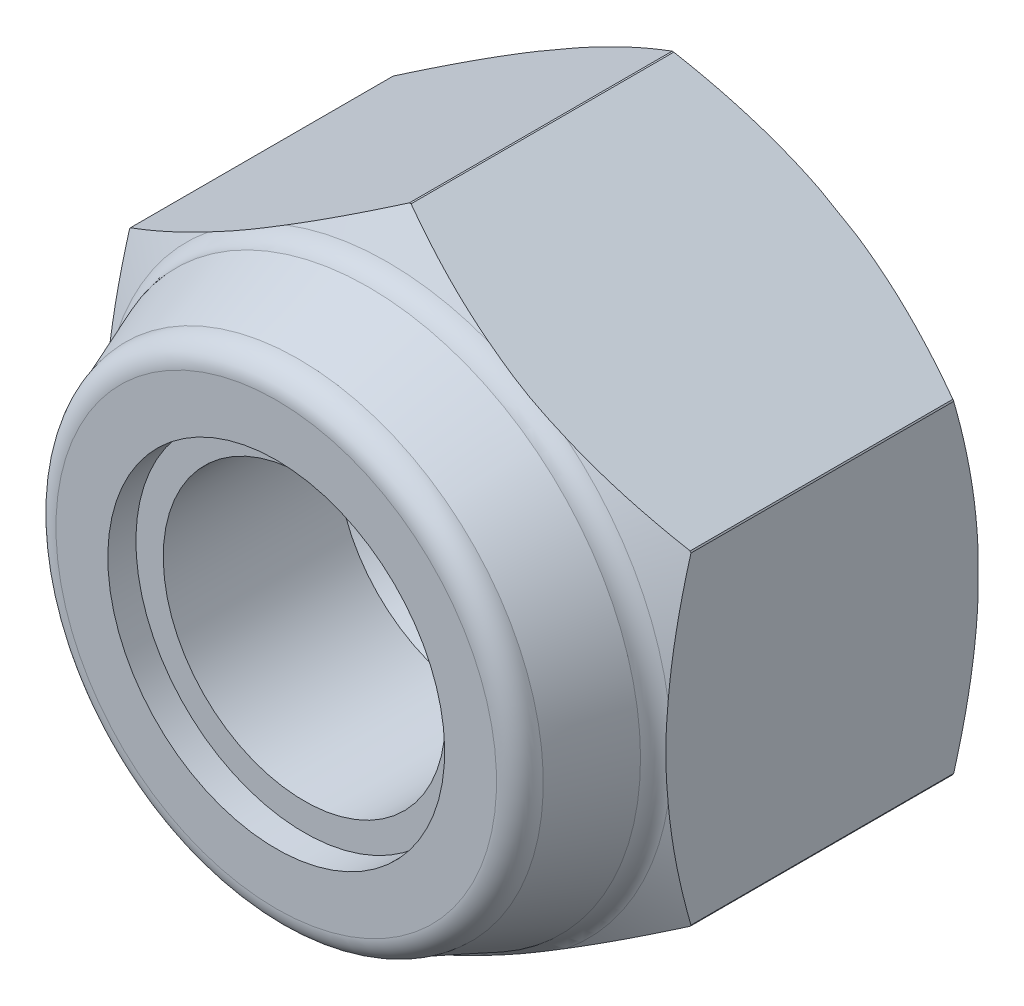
ISO-10303-21;
HEADER;
FILE_DESCRIPTION(('STEP AP214'),'2;1');
FILE_NAME('part.step','',(''),(''),'','','');
FILE_SCHEMA(('AUTOMOTIVE_DESIGN { 1 0 10303 214 1 1 1 1 }'));
ENDSEC;
DATA;
#1=APPLICATION_CONTEXT('core data for automotive mechanical design processes');
#2=APPLICATION_PROTOCOL_DEFINITION('international standard','automotive_design',2000,#1);
#3=PRODUCT_CONTEXT('',#1,'mechanical');
#4=PRODUCT('Part','Part','',(#3));
#5=PRODUCT_RELATED_PRODUCT_CATEGORY('part','',(#4));
#6=PRODUCT_DEFINITION_FORMATION('','',#4);
#7=PRODUCT_DEFINITION_CONTEXT('part definition',#1,'design');
#8=PRODUCT_DEFINITION('design','',#6,#7);
#9=PRODUCT_DEFINITION_SHAPE('','',#8);
#10=(LENGTH_UNIT() NAMED_UNIT(*) SI_UNIT(.MILLI.,.METRE.));
#11=(NAMED_UNIT(*) PLANE_ANGLE_UNIT() SI_UNIT($,.RADIAN.));
#12=(NAMED_UNIT(*) SI_UNIT($,.STERADIAN.) SOLID_ANGLE_UNIT());
#13=UNCERTAINTY_MEASURE_WITH_UNIT(LENGTH_MEASURE(1.E-05),#10,'distance_accuracy_value','');
#14=(GEOMETRIC_REPRESENTATION_CONTEXT(3) GLOBAL_UNCERTAINTY_ASSIGNED_CONTEXT((#13)) GLOBAL_UNIT_ASSIGNED_CONTEXT((#10,
#11,#12)) REPRESENTATION_CONTEXT('',''));
#15=CARTESIAN_POINT('',(0.,0.,0.));
#16=DIRECTION('',(0.,0.,1.));
#17=DIRECTION('',(1.,0.,0.));
#18=AXIS2_PLACEMENT_3D('',#15,#16,#17);
#19=CARTESIAN_POINT('',(0.,2.5075,0.));
#20=DIRECTION('',(0.,0.,-1.));
#21=DIRECTION('',(0.,-1.,0.));
#22=AXIS2_PLACEMENT_3D('',#19,#20,#21);
#23=PLANE('',#22);
#24=DIRECTION('',(-0.866025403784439,-0.5,0.));
#25=VECTOR('',#24,1.);
#26=CARTESIAN_POINT('',(-1.95711032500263,4.64356451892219,0.));
#27=LINE('',#26,#25);
#28=CARTESIAN_POINT('',(-2.16433833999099,4.52392136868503,0.));
#29=VERTEX_POINT('',#28);
#30=CARTESIAN_POINT('',(-2.83566166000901,4.13633266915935,0.));
#31=VERTEX_POINT('',#30);
#32=EDGE_CURVE('E355',#29,#31,#27,.T.);
#33=ORIENTED_EDGE('',*,*,#32,.F.);
#34=CARTESIAN_POINT('',(0.,0.,0.));
#35=DIRECTION('',(0.,0.,1.));
#36=DIRECTION('',(0.,1.,0.));
#37=AXIS2_PLACEMENT_3D('',#34,#35,#36);
#38=CIRCLE('',#37,5.015);
#39=CARTESIAN_POINT('',(2.164338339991,4.52392136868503,0.));
#40=VERTEX_POINT('',#39);
#41=EDGE_CURVE('E284',#40,#29,#38,.T.);
#42=ORIENTED_EDGE('',*,*,#41,.F.);
#43=DIRECTION('',(-0.866025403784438,0.5,0.));
#44=VECTOR('',#43,1.);
#45=CARTESIAN_POINT('',(1.95711032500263,4.64356451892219,0.));
#46=LINE('',#45,#44);
#47=CARTESIAN_POINT('',(2.83566166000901,4.13633266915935,0.));
#48=VERTEX_POINT('',#47);
#49=EDGE_CURVE('E322',#48,#40,#46,.T.);
#50=ORIENTED_EDGE('',*,*,#49,.F.);
#51=CARTESIAN_POINT('',(0.,0.,0.));
#52=DIRECTION('',(0.,0.,1.));
#53=DIRECTION('',(0.,1.,0.));
#54=AXIS2_PLACEMENT_3D('',#51,#52,#53);
#55=CIRCLE('',#54,5.015);
#56=CARTESIAN_POINT('',(5.,0.387588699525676,0.));
#57=VERTEX_POINT('',#56);
#58=EDGE_CURVE('E87',#57,#48,#55,.T.);
#59=ORIENTED_EDGE('',*,*,#58,.F.);
#60=DIRECTION('',(0.,1.,0.));
#61=VECTOR('',#60,1.);
#62=CARTESIAN_POINT('',(5.,1.25375,0.));
#63=LINE('',#62,#61);
#64=CARTESIAN_POINT('',(5.,-0.387588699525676,0.));
#65=VERTEX_POINT('',#64);
#66=EDGE_CURVE('E390',#65,#57,#63,.T.);
#67=ORIENTED_EDGE('',*,*,#66,.F.);
#68=CARTESIAN_POINT('',(0.,0.,0.));
#69=DIRECTION('',(0.,0.,1.));
#70=DIRECTION('',(0.,1.,0.));
#71=AXIS2_PLACEMENT_3D('',#68,#69,#70);
#72=CIRCLE('',#71,5.015);
#73=CARTESIAN_POINT('',(2.835661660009,-4.13633266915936,0.));
#74=VERTEX_POINT('',#73);
#75=EDGE_CURVE('E312',#74,#65,#72,.T.);
#76=ORIENTED_EDGE('',*,*,#75,.F.);
#77=DIRECTION('',(0.866025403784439,0.5,0.));
#78=VECTOR('',#77,1.);
#79=CARTESIAN_POINT('',(3.04288967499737,-4.01668951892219,0.));
#80=LINE('',#79,#78);
#81=CARTESIAN_POINT('',(2.164338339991,-4.52392136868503,0.));
#82=VERTEX_POINT('',#81);
#83=EDGE_CURVE('E252',#82,#74,#80,.T.);
#84=ORIENTED_EDGE('',*,*,#83,.F.);
#85=CARTESIAN_POINT('',(0.,0.,0.));
#86=DIRECTION('',(0.,0.,1.));
#87=DIRECTION('',(0.,1.,0.));
#88=AXIS2_PLACEMENT_3D('',#85,#86,#87);
#89=CIRCLE('',#88,5.015);
#90=CARTESIAN_POINT('',(-2.16433833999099,-4.52392136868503,0.));
#91=VERTEX_POINT('',#90);
#92=EDGE_CURVE('E362',#91,#82,#89,.T.);
#93=ORIENTED_EDGE('',*,*,#92,.F.);
#94=DIRECTION('',(0.866025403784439,-0.5,0.));
#95=VECTOR('',#94,1.);
#96=CARTESIAN_POINT('',(-3.04288967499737,-4.01668951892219,0.));
#97=LINE('',#96,#95);
#98=CARTESIAN_POINT('',(-2.83566166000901,-4.13633266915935,0.));
#99=VERTEX_POINT('',#98);
#100=EDGE_CURVE('E251',#99,#91,#97,.T.);
#101=ORIENTED_EDGE('',*,*,#100,.F.);
#102=CARTESIAN_POINT('',(0.,0.,0.));
#103=DIRECTION('',(0.,0.,1.));
#104=DIRECTION('',(0.,1.,0.));
#105=AXIS2_PLACEMENT_3D('',#102,#103,#104);
#106=CIRCLE('',#105,5.015);
#107=CARTESIAN_POINT('',(-5.,-0.387588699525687,0.));
#108=VERTEX_POINT('',#107);
#109=EDGE_CURVE('E309',#108,#99,#106,.T.);
#110=ORIENTED_EDGE('',*,*,#109,.F.);
#111=DIRECTION('',(0.,-1.,0.));
#112=VECTOR('',#111,1.);
#113=CARTESIAN_POINT('',(-5.,1.25375,0.));
#114=LINE('',#113,#112);
#115=CARTESIAN_POINT('',(-5.,0.387588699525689,0.));
#116=VERTEX_POINT('',#115);
#117=EDGE_CURVE('E219',#116,#108,#114,.T.);
#118=ORIENTED_EDGE('',*,*,#117,.F.);
#119=CARTESIAN_POINT('',(0.,0.,0.));
#120=DIRECTION('',(0.,0.,1.));
#121=DIRECTION('',(0.,1.,0.));
#122=AXIS2_PLACEMENT_3D('',#119,#120,#121);
#123=CIRCLE('',#122,5.015);
#124=EDGE_CURVE('E253',#31,#116,#123,.T.);
#125=ORIENTED_EDGE('',*,*,#124,.F.);
#126=EDGE_LOOP('',(#33,#42,#50,#59,#67,#76,#84,#93,#101,#110,#118,#125));
#127=FACE_BOUND('',#126,.T.);
#128=CARTESIAN_POINT('',(0.,0.,0.));
#129=DIRECTION('',(0.,0.,1.));
#130=DIRECTION('',(0.,1.,0.));
#131=AXIS2_PLACEMENT_3D('',#128,#129,#130);
#132=CIRCLE('',#131,3.);
#133=CARTESIAN_POINT('',(0.,3.,0.));
#134=VERTEX_POINT('',#133);
#135=EDGE_CURVE('E302',#134,#134,#132,.T.);
#136=ORIENTED_EDGE('',*,*,#135,.T.);
#137=EDGE_LOOP('',(#136));
#138=FACE_BOUND('',#137,.T.);
#139=ADVANCED_FACE('F15',(#127,#138),#23,.T.);
#140=CARTESIAN_POINT('',(0.,1.962,7.5));
#141=DIRECTION('',(0.,0.,1.));
#142=DIRECTION('',(0.,1.,0.));
#143=AXIS2_PLACEMENT_3D('',#140,#141,#142);
#144=PLANE('',#143);
#145=CARTESIAN_POINT('',(0.,0.,7.5));
#146=DIRECTION('',(0.,0.,1.));
#147=DIRECTION('',(0.,1.,0.));
#148=AXIS2_PLACEMENT_3D('',#145,#146,#147);
#149=CIRCLE('',#148,3.924);
#150=CARTESIAN_POINT('',(0.,3.924,7.5));
#151=VERTEX_POINT('',#150);
#152=EDGE_CURVE('E9',#151,#151,#149,.T.);
#153=ORIENTED_EDGE('',*,*,#152,.T.);
#154=EDGE_LOOP('',(#153));
#155=FACE_BOUND('',#154,.T.);
#156=CARTESIAN_POINT('',(0.,0.,7.5));
#157=DIRECTION('',(0.,0.,-1.));
#158=DIRECTION('',(0.,1.,0.));
#159=AXIS2_PLACEMENT_3D('',#156,#157,#158);
#160=CIRCLE('',#159,3.);
#161=CARTESIAN_POINT('',(0.,3.,7.5));
#162=VERTEX_POINT('',#161);
#163=EDGE_CURVE('E296',#162,#162,#160,.T.);
#164=ORIENTED_EDGE('',*,*,#163,.T.);
#165=EDGE_LOOP('',(#164));
#166=FACE_BOUND('',#165,.T.);
#167=ADVANCED_FACE('F690',(#155,#166),#144,.T.);
#168=CARTESIAN_POINT('',(0.,0.,7.064));
#169=DIRECTION('',(0.,0.,1.));
#170=DIRECTION('',(1.,0.,0.));
#171=AXIS2_PLACEMENT_3D('',#168,#169,#170);
#172=TOROIDAL_SURFACE('',#171,3.924,0.436);
#173=CARTESIAN_POINT('',(0.,0.,7.10199990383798));
#174=DIRECTION('',(0.,0.,1.));
#175=DIRECTION('',(0.,1.,0.));
#176=AXIS2_PLACEMENT_3D('',#173,#174,#175);
#177=CIRCLE('',#176,4.358340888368);
#178=CARTESIAN_POINT('',(0.,4.358340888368,7.10199990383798));
#179=VERTEX_POINT('',#178);
#180=EDGE_CURVE('E27',#179,#179,#177,.T.);
#181=ORIENTED_EDGE('',*,*,#180,.T.);
#182=EDGE_LOOP('',(#181));
#183=FACE_BOUND('',#182,.T.);
#184=ORIENTED_EDGE('',*,*,#152,.F.);
#185=EDGE_LOOP('',(#184));
#186=FACE_BOUND('',#185,.T.);
#187=ADVANCED_FACE('F724',(#183,#186),#172,.T.);
#188=CARTESIAN_POINT('',(0.,0.,6.47993828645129));
#189=DIRECTION('',(0.,0.,-1.));
#190=DIRECTION('',(0.,1.,0.));
#191=AXIS2_PLACEMENT_3D('',#188,#189,#190);
#192=CONICAL_SURFACE('',#191,4.60252,0.374051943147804);
#193=CARTESIAN_POINT('',(0.,0.,5.85787666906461));
#194=DIRECTION('',(0.,0.,1.));
#195=DIRECTION('',(0.,1.,0.));
#196=AXIS2_PLACEMENT_3D('',#193,#194,#195);
#197=CIRCLE('',#196,4.846699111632);
#198=CARTESIAN_POINT('',(0.,4.846699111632,5.85787666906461));
#199=VERTEX_POINT('',#198);
#200=EDGE_CURVE('E283',#199,#199,#197,.T.);
#201=ORIENTED_EDGE('',*,*,#200,.T.);
#202=EDGE_LOOP('',(#201));
#203=FACE_BOUND('',#202,.T.);
#204=ORIENTED_EDGE('',*,*,#180,.F.);
#205=EDGE_LOOP('',(#204));
#206=FACE_BOUND('',#205,.T.);
#207=ADVANCED_FACE('F608',(#203,#206),#192,.T.);
#208=CARTESIAN_POINT('',(0.,0.,5.31565109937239));
#209=DIRECTION('',(0.,0.,-1.));
#210=DIRECTION('',(0.,1.,0.));
#211=AXIS2_PLACEMENT_3D('',#208,#209,#210);
#212=CONICAL_SURFACE('',#211,5.41402,1.0471975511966);
#213=CARTESIAN_POINT('',(-1.81023153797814,4.72836502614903,5.51828949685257));
#214=CARTESIAN_POINT('',(-0.97069408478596,5.21307220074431,5.43024338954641));
#215=CARTESIAN_POINT('',(-0.0147598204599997,5.76498110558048,5.11301270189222));
#216=(BOUNDED_CURVE() B_SPLINE_CURVE(2,(#213,#214,#215),.UNSPECIFIED.,.F.,
.F.) B_SPLINE_CURVE_WITH_KNOTS((3,3),(0.,2.11486621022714),
.UNSPECIFIED.) CURVE() GEOMETRIC_REPRESENTATION_ITEM() RATIONAL_B_SPLINE_CURVE((1.,
1.01885005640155,1.)) REPRESENTATION_ITEM(''));
#217=CARTESIAN_POINT('',(-1.81023153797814,4.72836502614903,5.51828949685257));
#218=VERTEX_POINT('',#217);
#219=CARTESIAN_POINT('',(-0.0147598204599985,5.76498110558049,5.11301270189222));
#220=VERTEX_POINT('',#219);
#221=EDGE_CURVE('E389',#218,#220,#216,.T.);
#222=ORIENTED_EDGE('',*,*,#221,.F.);
#223=CARTESIAN_POINT('',(0.,0.,5.51828949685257));
#224=DIRECTION('',(0.,0.,1.));
#225=DIRECTION('',(0.,1.,0.));
#226=AXIS2_PLACEMENT_3D('',#223,#224,#225);
#227=CIRCLE('',#226,5.06304);
#228=CARTESIAN_POINT('',(1.81023153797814,4.72836502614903,5.51828949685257));
#229=VERTEX_POINT('',#228);
#230=EDGE_CURVE('E371',#229,#218,#227,.T.);
#231=ORIENTED_EDGE('',*,*,#230,.F.);
#232=CARTESIAN_POINT('',(0.0147598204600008,5.76498110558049,5.11301270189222));
#233=CARTESIAN_POINT('',(0.970694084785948,5.21307220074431,5.4302433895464));
#234=CARTESIAN_POINT('',(1.81023153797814,4.72836502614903,5.51828949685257));
#235=(BOUNDED_CURVE() B_SPLINE_CURVE(2,(#232,#233,#234),.UNSPECIFIED.,.F.,
.F.) B_SPLINE_CURVE_WITH_KNOTS((3,3),(0.,2.11486621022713),
.UNSPECIFIED.) CURVE() GEOMETRIC_REPRESENTATION_ITEM() RATIONAL_B_SPLINE_CURVE((1.,
1.01885005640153,1.)) REPRESENTATION_ITEM(''));
#236=CARTESIAN_POINT('',(0.0147598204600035,5.76498110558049,5.11301270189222));
#237=VERTEX_POINT('',#236);
#238=EDGE_CURVE('E321',#237,#229,#235,.T.);
#239=ORIENTED_EDGE('',*,*,#238,.F.);
#240=CARTESIAN_POINT('',(0.,0.,5.11301270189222));
#241=DIRECTION('',(0.,0.,1.));
#242=DIRECTION('',(0.,1.,0.));
#243=AXIS2_PLACEMENT_3D('',#240,#241,#242);
#244=CIRCLE('',#243,5.765);
#245=EDGE_CURVE('E288',#237,#220,#244,.T.);
#246=ORIENTED_EDGE('',*,*,#245,.T.);
#247=EDGE_LOOP('',(#222,#231,#239,#246));
#248=FACE_BOUND('',#247,.T.);
#249=ADVANCED_FACE('F714',(#248),#212,.T.);
#250=CARTESIAN_POINT('',(0.,0.,2.77301270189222));
#251=DIRECTION('',(0.,0.,-1.));
#252=DIRECTION('',(0.,1.,0.));
#253=AXIS2_PLACEMENT_3D('',#250,#251,#252);
#254=CYLINDRICAL_SURFACE('',#253,5.765);
#255=DIRECTION('',(0.,0.,-1.));
#256=VECTOR('',#255,1.);
#257=CARTESIAN_POINT('',(-0.0147598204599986,5.76498110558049,2.77301270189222));
#258=LINE('',#257,#256);
#259=CARTESIAN_POINT('',(-0.0147598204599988,5.76498110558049,0.43301270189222));
#260=VERTEX_POINT('',#259);
#261=EDGE_CURVE('E384',#220,#260,#258,.T.);
#262=ORIENTED_EDGE('',*,*,#261,.F.);
#263=ORIENTED_EDGE('',*,*,#245,.F.);
#264=DIRECTION('',(0.,0.,1.));
#265=VECTOR('',#264,1.);
#266=CARTESIAN_POINT('',(0.0147598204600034,5.76498110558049,2.77301270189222));
#267=LINE('',#266,#265);
#268=CARTESIAN_POINT('',(0.0147598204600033,5.76498110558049,0.43301270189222));
#269=VERTEX_POINT('',#268);
#270=EDGE_CURVE('E295',#269,#237,#267,.T.);
#271=ORIENTED_EDGE('',*,*,#270,.F.);
#272=CARTESIAN_POINT('',(0.,0.,0.43301270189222));
#273=DIRECTION('',(0.,0.,1.));
#274=DIRECTION('',(0.,1.,0.));
#275=AXIS2_PLACEMENT_3D('',#272,#273,#274);
#276=CIRCLE('',#275,5.765);
#277=EDGE_CURVE('E259',#269,#260,#276,.T.);
#278=ORIENTED_EDGE('',*,*,#277,.T.);
#279=EDGE_LOOP('',(#262,#263,#271,#278));
#280=FACE_BOUND('',#279,.T.);
#281=ADVANCED_FACE('F717',(#280),#254,.T.);
#282=CARTESIAN_POINT('',(0.,0.,0.21650635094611));
#283=DIRECTION('',(0.,0.,1.));
#284=DIRECTION('',(0.,1.,0.));
#285=AXIS2_PLACEMENT_3D('',#282,#283,#284);
#286=CONICAL_SURFACE('',#285,5.39,1.0471975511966);
#287=CARTESIAN_POINT('',(-0.0147598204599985,5.76498110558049,0.43301270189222));
#288=CARTESIAN_POINT('',(-1.16432569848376,5.10127893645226,0.051524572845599));
#289=CARTESIAN_POINT('',(-2.164338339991,4.52392136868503,0.));
#290=(BOUNDED_CURVE() B_SPLINE_CURVE(2,(#287,#288,#289),.UNSPECIFIED.,.F.,
.F.) B_SPLINE_CURVE_WITH_KNOTS((3,3),(0.,2.5240589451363),
.UNSPECIFIED.) CURVE() GEOMETRIC_REPRESENTATION_ITEM() RATIONAL_B_SPLINE_CURVE((1.,
1.02761090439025,1.)) REPRESENTATION_ITEM(''));
#291=EDGE_CURVE('E367',#260,#29,#290,.T.);
#292=ORIENTED_EDGE('',*,*,#291,.F.);
#293=ORIENTED_EDGE('',*,*,#277,.F.);
#294=CARTESIAN_POINT('',(2.16433833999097,4.52392136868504,0.));
#295=CARTESIAN_POINT('',(1.16432569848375,5.10127893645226,0.051524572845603));
#296=CARTESIAN_POINT('',(0.014759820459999,5.76498110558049,0.43301270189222));
#297=(BOUNDED_CURVE() B_SPLINE_CURVE(2,(#294,#295,#296),.UNSPECIFIED.,.F.,
.F.) B_SPLINE_CURVE_WITH_KNOTS((3,3),(0.,2.52405894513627),
.UNSPECIFIED.) CURVE() GEOMETRIC_REPRESENTATION_ITEM() RATIONAL_B_SPLINE_CURVE((1.,
1.02761090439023,1.)) REPRESENTATION_ITEM(''));
#298=EDGE_CURVE('E289',#40,#269,#297,.T.);
#299=ORIENTED_EDGE('',*,*,#298,.F.);
#300=ORIENTED_EDGE('',*,*,#41,.T.);
#301=EDGE_LOOP('',(#292,#293,#299,#300));
#302=FACE_BOUND('',#301,.T.);
#303=ADVANCED_FACE('F763',(#302),#286,.T.);
#304=CARTESIAN_POINT('',(0.,0.,0.21650635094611));
#305=DIRECTION('',(0.,0.,1.));
#306=DIRECTION('',(0.,1.,0.));
#307=AXIS2_PLACEMENT_3D('',#304,#305,#306);
#308=CONICAL_SURFACE('',#307,5.39,1.0471975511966);
#309=CARTESIAN_POINT('',(-2.835661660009,4.13633266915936,0.));
#310=CARTESIAN_POINT('',(-3.83567430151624,3.55897510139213,0.0515245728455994));
#311=CARTESIAN_POINT('',(-4.98524017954,2.89527293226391,0.43301270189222));
#312=(BOUNDED_CURVE() B_SPLINE_CURVE(2,(#309,#310,#311),.UNSPECIFIED.,.F.,
.F.) B_SPLINE_CURVE_WITH_KNOTS((3,3),(0.,2.5240589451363),
.UNSPECIFIED.) CURVE() GEOMETRIC_REPRESENTATION_ITEM() RATIONAL_B_SPLINE_CURVE((1.,
1.02761090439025,1.)) REPRESENTATION_ITEM(''));
#313=CARTESIAN_POINT('',(-4.98524017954,2.89527293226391,0.43301270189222));
#314=VERTEX_POINT('',#313);
#315=EDGE_CURVE('E348',#31,#314,#312,.T.);
#316=ORIENTED_EDGE('',*,*,#315,.F.);
#317=ORIENTED_EDGE('',*,*,#124,.T.);
#318=CARTESIAN_POINT('',(-5.,2.86970817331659,0.43301270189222));
#319=CARTESIAN_POINT('',(-5.,1.54230383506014,0.0515245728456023));
#320=CARTESIAN_POINT('',(-5.,0.387588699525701,0.));
#321=(BOUNDED_CURVE() B_SPLINE_CURVE(2,(#318,#319,#320),.UNSPECIFIED.,.F.,
.F.) B_SPLINE_CURVE_WITH_KNOTS((3,3),(0.,2.52405894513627),
.UNSPECIFIED.) CURVE() GEOMETRIC_REPRESENTATION_ITEM() RATIONAL_B_SPLINE_CURVE((1.,
1.02761090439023,1.)) REPRESENTATION_ITEM(''));
#322=CARTESIAN_POINT('',(-5.,2.86970817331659,0.43301270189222));
#323=VERTEX_POINT('',#322);
#324=EDGE_CURVE('E224',#323,#116,#321,.T.);
#325=ORIENTED_EDGE('',*,*,#324,.F.);
#326=CARTESIAN_POINT('',(0.,0.,0.43301270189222));
#327=DIRECTION('',(0.,0.,1.));
#328=DIRECTION('',(0.,1.,0.));
#329=AXIS2_PLACEMENT_3D('',#326,#327,#328);
#330=CIRCLE('',#329,5.765);
#331=EDGE_CURVE('E374',#314,#323,#330,.T.);
#332=ORIENTED_EDGE('',*,*,#331,.F.);
#333=EDGE_LOOP('',(#316,#317,#325,#332));
#334=FACE_BOUND('',#333,.T.);
#335=ADVANCED_FACE('F862',(#334),#308,.T.);
#336=CARTESIAN_POINT('',(0.,0.,0.21650635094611));
#337=DIRECTION('',(0.,0.,1.));
#338=DIRECTION('',(0.,1.,0.));
#339=AXIS2_PLACEMENT_3D('',#336,#337,#338);
#340=CONICAL_SURFACE('',#339,5.39,1.0471975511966);
#341=CARTESIAN_POINT('',(4.98524017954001,2.89527293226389,0.43301270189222));
#342=CARTESIAN_POINT('',(3.83567430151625,3.55897510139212,0.0515245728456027));
#343=CARTESIAN_POINT('',(2.83566166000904,4.13633266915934,0.));
#344=(BOUNDED_CURVE() B_SPLINE_CURVE(2,(#341,#342,#343),.UNSPECIFIED.,.F.,
.F.) B_SPLINE_CURVE_WITH_KNOTS((3,3),(0.,2.52405894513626),
.UNSPECIFIED.) CURVE() GEOMETRIC_REPRESENTATION_ITEM() RATIONAL_B_SPLINE_CURVE((1.,
1.02761090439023,1.)) REPRESENTATION_ITEM(''));
#345=CARTESIAN_POINT('',(4.98524017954,2.8952729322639,0.433012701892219));
#346=VERTEX_POINT('',#345);
#347=EDGE_CURVE('E327',#346,#48,#344,.T.);
#348=ORIENTED_EDGE('',*,*,#347,.F.);
#349=CARTESIAN_POINT('',(0.,0.,0.43301270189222));
#350=DIRECTION('',(0.,0.,1.));
#351=DIRECTION('',(0.,1.,0.));
#352=AXIS2_PLACEMENT_3D('',#349,#350,#351);
#353=CIRCLE('',#352,5.765);
#354=CARTESIAN_POINT('',(5.,2.86970817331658,0.433012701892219));
#355=VERTEX_POINT('',#354);
#356=EDGE_CURVE('E98',#355,#346,#353,.T.);
#357=ORIENTED_EDGE('',*,*,#356,.F.);
#358=CARTESIAN_POINT('',(5.,0.387588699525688,0.));
#359=CARTESIAN_POINT('',(5.00000000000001,1.54230383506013,0.0515245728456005));
#360=CARTESIAN_POINT('',(5.,2.86970817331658,0.433012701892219));
#361=(BOUNDED_CURVE() B_SPLINE_CURVE(2,(#358,#359,#360),.UNSPECIFIED.,.F.,
.F.) B_SPLINE_CURVE_WITH_KNOTS((3,3),(0.,2.52405894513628),
.UNSPECIFIED.) CURVE() GEOMETRIC_REPRESENTATION_ITEM() RATIONAL_B_SPLINE_CURVE((1.,
1.02761090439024,1.)) REPRESENTATION_ITEM(''));
#362=EDGE_CURVE('E326',#57,#355,#361,.T.);
#363=ORIENTED_EDGE('',*,*,#362,.F.);
#364=ORIENTED_EDGE('',*,*,#58,.T.);
#365=EDGE_LOOP('',(#348,#357,#363,#364));
#366=FACE_BOUND('',#365,.T.);
#367=ADVANCED_FACE('F875',(#366),#340,.T.);
#368=CARTESIAN_POINT('',(0.,0.,0.21650635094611));
#369=DIRECTION('',(0.,0.,1.));
#370=DIRECTION('',(0.,1.,0.));
#371=AXIS2_PLACEMENT_3D('',#368,#369,#370);
#372=CONICAL_SURFACE('',#371,5.39,1.0471975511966);
#373=CARTESIAN_POINT('',(-5.,-0.387588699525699,0.));
#374=CARTESIAN_POINT('',(-5.,-1.54230383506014,0.0515245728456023));
#375=CARTESIAN_POINT('',(-5.,-2.86970817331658,0.43301270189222));
#376=(BOUNDED_CURVE() B_SPLINE_CURVE(2,(#373,#374,#375),.UNSPECIFIED.,.F.,
.F.) B_SPLINE_CURVE_WITH_KNOTS((3,3),(0.,2.52405894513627),
.UNSPECIFIED.) CURVE() GEOMETRIC_REPRESENTATION_ITEM() RATIONAL_B_SPLINE_CURVE((1.,
1.02761090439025,1.)) REPRESENTATION_ITEM(''));
#377=CARTESIAN_POINT('',(-5.,-2.86970817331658,0.43301270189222));
#378=VERTEX_POINT('',#377);
#379=EDGE_CURVE('E196',#108,#378,#376,.T.);
#380=ORIENTED_EDGE('',*,*,#379,.F.);
#381=ORIENTED_EDGE('',*,*,#109,.T.);
#382=CARTESIAN_POINT('',(-4.98524017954,-2.8952729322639,0.43301270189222));
#383=CARTESIAN_POINT('',(-3.83567430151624,-3.55897510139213,0.0515245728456));
#384=CARTESIAN_POINT('',(-2.83566166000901,-4.13633266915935,0.));
#385=(BOUNDED_CURVE() B_SPLINE_CURVE(2,(#382,#383,#384),.UNSPECIFIED.,.F.,
.F.) B_SPLINE_CURVE_WITH_KNOTS((3,3),(0.,2.52405894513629),
.UNSPECIFIED.) CURVE() GEOMETRIC_REPRESENTATION_ITEM() RATIONAL_B_SPLINE_CURVE((1.,
1.02761090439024,1.)) REPRESENTATION_ITEM(''));
#386=CARTESIAN_POINT('',(-4.98524017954,-2.8952729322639,0.43301270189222));
#387=VERTEX_POINT('',#386);
#388=EDGE_CURVE('E199',#387,#99,#385,.T.);
#389=ORIENTED_EDGE('',*,*,#388,.F.);
#390=CARTESIAN_POINT('',(0.,0.,0.43301270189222));
#391=DIRECTION('',(0.,0.,1.));
#392=DIRECTION('',(0.,1.,0.));
#393=AXIS2_PLACEMENT_3D('',#390,#391,#392);
#394=CIRCLE('',#393,5.765);
#395=EDGE_CURVE('E192',#378,#387,#394,.T.);
#396=ORIENTED_EDGE('',*,*,#395,.F.);
#397=EDGE_LOOP('',(#380,#381,#389,#396));
#398=FACE_BOUND('',#397,.T.);
#399=ADVANCED_FACE('F194',(#398),#372,.T.);
#400=CARTESIAN_POINT('',(0.,0.,0.21650635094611));
#401=DIRECTION('',(0.,0.,1.));
#402=DIRECTION('',(0.,1.,0.));
#403=AXIS2_PLACEMENT_3D('',#400,#401,#402);
#404=CONICAL_SURFACE('',#403,5.39,1.0471975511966);
#405=CARTESIAN_POINT('',(5.,-2.86970817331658,0.433012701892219));
#406=CARTESIAN_POINT('',(5.00000000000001,-1.54230383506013,0.0515245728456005));
#407=CARTESIAN_POINT('',(5.,-0.387588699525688,0.));
#408=(BOUNDED_CURVE() B_SPLINE_CURVE(2,(#405,#406,#407),.UNSPECIFIED.,.F.,
.F.) B_SPLINE_CURVE_WITH_KNOTS((3,3),(0.,2.52405894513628),
.UNSPECIFIED.) CURVE() GEOMETRIC_REPRESENTATION_ITEM() RATIONAL_B_SPLINE_CURVE((1.,
1.02761090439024,1.)) REPRESENTATION_ITEM(''));
#409=CARTESIAN_POINT('',(5.,-2.86970817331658,0.433012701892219));
#410=VERTEX_POINT('',#409);
#411=EDGE_CURVE('E245',#410,#65,#408,.T.);
#412=ORIENTED_EDGE('',*,*,#411,.F.);
#413=CARTESIAN_POINT('',(0.,0.,0.43301270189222));
#414=DIRECTION('',(0.,0.,1.));
#415=DIRECTION('',(0.,1.,0.));
#416=AXIS2_PLACEMENT_3D('',#413,#414,#415);
#417=CIRCLE('',#416,5.765);
#418=CARTESIAN_POINT('',(4.98524017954,-2.8952729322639,0.433012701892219));
#419=VERTEX_POINT('',#418);
#420=EDGE_CURVE('E204',#419,#410,#417,.T.);
#421=ORIENTED_EDGE('',*,*,#420,.F.);
#422=CARTESIAN_POINT('',(2.83566166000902,-4.13633266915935,0.));
#423=CARTESIAN_POINT('',(3.83567430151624,-3.55897510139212,0.0515245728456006));
#424=CARTESIAN_POINT('',(4.98524017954,-2.8952729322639,0.43301270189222));
#425=(BOUNDED_CURVE() B_SPLINE_CURVE(2,(#422,#423,#424),.UNSPECIFIED.,.F.,
.F.) B_SPLINE_CURVE_WITH_KNOTS((3,3),(0.,2.52405894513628),
.UNSPECIFIED.) CURVE() GEOMETRIC_REPRESENTATION_ITEM() RATIONAL_B_SPLINE_CURVE((1.,
1.02761090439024,1.)) REPRESENTATION_ITEM(''));
#426=EDGE_CURVE('E265',#74,#419,#425,.T.);
#427=ORIENTED_EDGE('',*,*,#426,.F.);
#428=ORIENTED_EDGE('',*,*,#75,.T.);
#429=EDGE_LOOP('',(#412,#421,#427,#428));
#430=FACE_BOUND('',#429,.T.);
#431=ADVANCED_FACE('F691',(#430),#404,.T.);
#432=CARTESIAN_POINT('',(0.,0.,0.21650635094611));
#433=DIRECTION('',(0.,0.,1.));
#434=DIRECTION('',(0.,1.,0.));
#435=AXIS2_PLACEMENT_3D('',#432,#433,#434);
#436=CONICAL_SURFACE('',#435,5.39,1.0471975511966);
#437=CARTESIAN_POINT('',(-2.16433833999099,-4.52392136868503,0.));
#438=CARTESIAN_POINT('',(-1.16432569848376,-5.10127893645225,0.0515245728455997));
#439=CARTESIAN_POINT('',(-0.0147598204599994,-5.76498110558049,0.43301270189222));
#440=(BOUNDED_CURVE() B_SPLINE_CURVE(2,(#437,#438,#439),.UNSPECIFIED.,.F.,
.F.) B_SPLINE_CURVE_WITH_KNOTS((3,3),(0.,2.52405894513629),
.UNSPECIFIED.) CURVE() GEOMETRIC_REPRESENTATION_ITEM() RATIONAL_B_SPLINE_CURVE((1.,
1.02761090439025,1.)) REPRESENTATION_ITEM(''));
#441=CARTESIAN_POINT('',(-0.0147598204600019,-5.76498110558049,0.43301270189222));
#442=VERTEX_POINT('',#441);
#443=EDGE_CURVE('E230',#91,#442,#440,.T.);
#444=ORIENTED_EDGE('',*,*,#443,.F.);
#445=ORIENTED_EDGE('',*,*,#92,.T.);
#446=CARTESIAN_POINT('',(0.0147598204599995,-5.76498110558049,0.43301270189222));
#447=CARTESIAN_POINT('',(1.16432569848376,-5.10127893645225,0.0515245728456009));
#448=CARTESIAN_POINT('',(2.16433833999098,-4.52392136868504,0.));
#449=(BOUNDED_CURVE() B_SPLINE_CURVE(2,(#446,#447,#448),.UNSPECIFIED.,.F.,
.F.) B_SPLINE_CURVE_WITH_KNOTS((3,3),(0.,2.52405894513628),
.UNSPECIFIED.) CURVE() GEOMETRIC_REPRESENTATION_ITEM() RATIONAL_B_SPLINE_CURVE((1.,
1.02761090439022,1.)) REPRESENTATION_ITEM(''));
#450=CARTESIAN_POINT('',(0.0147598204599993,-5.76498110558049,0.43301270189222));
#451=VERTEX_POINT('',#450);
#452=EDGE_CURVE('E328',#451,#82,#449,.T.);
#453=ORIENTED_EDGE('',*,*,#452,.F.);
#454=CARTESIAN_POINT('',(0.,0.,0.43301270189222));
#455=DIRECTION('',(0.,0.,1.));
#456=DIRECTION('',(0.,1.,0.));
#457=AXIS2_PLACEMENT_3D('',#454,#455,#456);
#458=CIRCLE('',#457,5.765);
#459=EDGE_CURVE('E266',#442,#451,#458,.T.);
#460=ORIENTED_EDGE('',*,*,#459,.F.);
#461=EDGE_LOOP('',(#444,#445,#453,#460));
#462=FACE_BOUND('',#461,.T.);
#463=ADVANCED_FACE('F694',(#462),#436,.T.);
#464=CARTESIAN_POINT('',(0.,0.,2.77301270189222));
#465=DIRECTION('',(0.,0.,-1.));
#466=DIRECTION('',(0.,1.,0.));
#467=AXIS2_PLACEMENT_3D('',#464,#465,#466);
#468=CYLINDRICAL_SURFACE('',#467,5.765);
#469=DIRECTION('',(0.,0.,1.));
#470=VECTOR('',#469,1.);
#471=CARTESIAN_POINT('',(-4.98524017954,2.89527293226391,2.77301270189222));
#472=LINE('',#471,#470);
#473=CARTESIAN_POINT('',(-4.98524017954,2.89527293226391,5.11301270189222));
#474=VERTEX_POINT('',#473);
#475=EDGE_CURVE('E354',#314,#474,#472,.T.);
#476=ORIENTED_EDGE('',*,*,#475,.F.);
#477=ORIENTED_EDGE('',*,*,#331,.T.);
#478=DIRECTION('',(0.,0.,-1.));
#479=VECTOR('',#478,1.);
#480=CARTESIAN_POINT('',(-5.,2.86970817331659,2.77301270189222));
#481=LINE('',#480,#479);
#482=CARTESIAN_POINT('',(-5.,2.86970817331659,5.11301270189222));
#483=VERTEX_POINT('',#482);
#484=EDGE_CURVE('E363',#483,#323,#481,.T.);
#485=ORIENTED_EDGE('',*,*,#484,.F.);
#486=CARTESIAN_POINT('',(0.,0.,5.11301270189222));
#487=DIRECTION('',(0.,0.,1.));
#488=DIRECTION('',(0.,1.,0.));
#489=AXIS2_PLACEMENT_3D('',#486,#487,#488);
#490=CIRCLE('',#489,5.765);
#491=EDGE_CURVE('E269',#474,#483,#490,.T.);
#492=ORIENTED_EDGE('',*,*,#491,.F.);
#493=EDGE_LOOP('',(#476,#477,#485,#492));
#494=FACE_BOUND('',#493,.T.);
#495=ADVANCED_FACE('F850',(#494),#468,.T.);
#496=CARTESIAN_POINT('',(0.,0.,2.77301270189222));
#497=DIRECTION('',(0.,0.,-1.));
#498=DIRECTION('',(0.,1.,0.));
#499=AXIS2_PLACEMENT_3D('',#496,#497,#498);
#500=CYLINDRICAL_SURFACE('',#499,5.765);
#501=DIRECTION('',(0.,0.,-1.));
#502=VECTOR('',#501,1.);
#503=CARTESIAN_POINT('',(4.98524017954,2.8952729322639,2.77301270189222));
#504=LINE('',#503,#502);
#505=CARTESIAN_POINT('',(4.98524017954,2.8952729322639,5.11301270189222));
#506=VERTEX_POINT('',#505);
#507=EDGE_CURVE('E341',#506,#346,#504,.T.);
#508=ORIENTED_EDGE('',*,*,#507,.F.);
#509=CARTESIAN_POINT('',(0.,0.,5.11301270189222));
#510=DIRECTION('',(0.,0.,1.));
#511=DIRECTION('',(0.,1.,0.));
#512=AXIS2_PLACEMENT_3D('',#509,#510,#511);
#513=CIRCLE('',#512,5.765);
#514=CARTESIAN_POINT('',(5.,2.86970817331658,5.11301270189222));
#515=VERTEX_POINT('',#514);
#516=EDGE_CURVE('E317',#515,#506,#513,.T.);
#517=ORIENTED_EDGE('',*,*,#516,.F.);
#518=DIRECTION('',(0.,0.,1.));
#519=VECTOR('',#518,1.);
#520=CARTESIAN_POINT('',(5.,2.86970817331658,2.77301270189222));
#521=LINE('',#520,#519);
#522=EDGE_CURVE('E394',#355,#515,#521,.T.);
#523=ORIENTED_EDGE('',*,*,#522,.F.);
#524=ORIENTED_EDGE('',*,*,#356,.T.);
#525=EDGE_LOOP('',(#508,#517,#523,#524));
#526=FACE_BOUND('',#525,.T.);
#527=ADVANCED_FACE('F596',(#526),#500,.T.);
#528=CARTESIAN_POINT('',(0.,0.,2.77301270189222));
#529=DIRECTION('',(0.,0.,-1.));
#530=DIRECTION('',(0.,1.,0.));
#531=AXIS2_PLACEMENT_3D('',#528,#529,#530);
#532=CYLINDRICAL_SURFACE('',#531,5.765);
#533=DIRECTION('',(0.,0.,1.));
#534=VECTOR('',#533,1.);
#535=CARTESIAN_POINT('',(-5.,-2.86970817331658,2.77301270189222));
#536=LINE('',#535,#534);
#537=CARTESIAN_POINT('',(-5.,-2.86970817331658,5.11301270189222));
#538=VERTEX_POINT('',#537);
#539=EDGE_CURVE('E207',#378,#538,#536,.T.);
#540=ORIENTED_EDGE('',*,*,#539,.F.);
#541=ORIENTED_EDGE('',*,*,#395,.T.);
#542=DIRECTION('',(0.,0.,-1.));
#543=VECTOR('',#542,1.);
#544=CARTESIAN_POINT('',(-4.98524017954,-2.8952729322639,2.77301270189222));
#545=LINE('',#544,#543);
#546=CARTESIAN_POINT('',(-4.98524017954,-2.8952729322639,5.11301270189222));
#547=VERTEX_POINT('',#546);
#548=EDGE_CURVE('E270',#547,#387,#545,.T.);
#549=ORIENTED_EDGE('',*,*,#548,.F.);
#550=CARTESIAN_POINT('',(0.,0.,5.11301270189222));
#551=DIRECTION('',(0.,0.,1.));
#552=DIRECTION('',(0.,1.,0.));
#553=AXIS2_PLACEMENT_3D('',#550,#551,#552);
#554=CIRCLE('',#553,5.765);
#555=EDGE_CURVE('E209',#538,#547,#554,.T.);
#556=ORIENTED_EDGE('',*,*,#555,.F.);
#557=EDGE_LOOP('',(#540,#541,#549,#556));
#558=FACE_BOUND('',#557,.T.);
#559=ADVANCED_FACE('F208',(#558),#532,.T.);
#560=CARTESIAN_POINT('',(0.,0.,2.77301270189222));
#561=DIRECTION('',(0.,0.,-1.));
#562=DIRECTION('',(0.,1.,0.));
#563=AXIS2_PLACEMENT_3D('',#560,#561,#562);
#564=CYLINDRICAL_SURFACE('',#563,5.765);
#565=DIRECTION('',(0.,0.,-1.));
#566=VECTOR('',#565,1.);
#567=CARTESIAN_POINT('',(5.,-2.86970817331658,2.77301270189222));
#568=LINE('',#567,#566);
#569=CARTESIAN_POINT('',(5.,-2.86970817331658,5.11301270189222));
#570=VERTEX_POINT('',#569);
#571=EDGE_CURVE('E241',#570,#410,#568,.T.);
#572=ORIENTED_EDGE('',*,*,#571,.F.);
#573=CARTESIAN_POINT('',(0.,0.,5.11301270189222));
#574=DIRECTION('',(0.,0.,1.));
#575=DIRECTION('',(0.,1.,0.));
#576=AXIS2_PLACEMENT_3D('',#573,#574,#575);
#577=CIRCLE('',#576,5.765);
#578=CARTESIAN_POINT('',(4.98524017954,-2.8952729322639,5.11301270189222));
#579=VERTEX_POINT('',#578);
#580=EDGE_CURVE('E282',#579,#570,#577,.T.);
#581=ORIENTED_EDGE('',*,*,#580,.F.);
#582=DIRECTION('',(0.,0.,1.));
#583=VECTOR('',#582,1.);
#584=CARTESIAN_POINT('',(4.98524017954,-2.8952729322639,2.77301270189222));
#585=LINE('',#584,#583);
#586=EDGE_CURVE('E260',#419,#579,#585,.T.);
#587=ORIENTED_EDGE('',*,*,#586,.F.);
#588=ORIENTED_EDGE('',*,*,#420,.T.);
#589=EDGE_LOOP('',(#572,#581,#587,#588));
#590=FACE_BOUND('',#589,.T.);
#591=ADVANCED_FACE('F824',(#590),#564,.T.);
#592=CARTESIAN_POINT('',(0.,0.,2.77301270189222));
#593=DIRECTION('',(0.,0.,-1.));
#594=DIRECTION('',(0.,1.,0.));
#595=AXIS2_PLACEMENT_3D('',#592,#593,#594);
#596=CYLINDRICAL_SURFACE('',#595,5.765);
#597=DIRECTION('',(0.,0.,1.));
#598=VECTOR('',#597,1.);
#599=CARTESIAN_POINT('',(-0.0147598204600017,-5.76498110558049,2.77301270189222));
#600=LINE('',#599,#598);
#601=CARTESIAN_POINT('',(-0.0147598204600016,-5.76498110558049,5.11301270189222));
#602=VERTEX_POINT('',#601);
#603=EDGE_CURVE('E519',#442,#602,#600,.T.);
#604=ORIENTED_EDGE('',*,*,#603,.F.);
#605=ORIENTED_EDGE('',*,*,#459,.T.);
#606=DIRECTION('',(0.,0.,-1.));
#607=VECTOR('',#606,1.);
#608=CARTESIAN_POINT('',(0.0147598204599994,-5.76498110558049,2.77301270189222));
#609=LINE('',#608,#607);
#610=CARTESIAN_POINT('',(0.0147598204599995,-5.76498110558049,5.11301270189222));
#611=VERTEX_POINT('',#610);
#612=EDGE_CURVE('E334',#611,#451,#609,.T.);
#613=ORIENTED_EDGE('',*,*,#612,.F.);
#614=CARTESIAN_POINT('',(0.,0.,5.11301270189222));
#615=DIRECTION('',(0.,0.,1.));
#616=DIRECTION('',(0.,1.,0.));
#617=AXIS2_PLACEMENT_3D('',#614,#615,#616);
#618=CIRCLE('',#617,5.765);
#619=EDGE_CURVE('E278',#602,#611,#618,.T.);
#620=ORIENTED_EDGE('',*,*,#619,.F.);
#621=EDGE_LOOP('',(#604,#605,#613,#620));
#622=FACE_BOUND('',#621,.T.);
#623=ADVANCED_FACE('F848',(#622),#596,.T.);
#624=CARTESIAN_POINT('',(0.,0.,5.31565109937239));
#625=DIRECTION('',(0.,0.,-1.));
#626=DIRECTION('',(0.,1.,0.));
#627=AXIS2_PLACEMENT_3D('',#624,#625,#626);
#628=CONICAL_SURFACE('',#627,5.41402,1.0471975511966);
#629=CARTESIAN_POINT('',(-4.98524017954,2.89527293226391,5.11301270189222));
#630=CARTESIAN_POINT('',(-4.02930591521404,3.44718183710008,5.4302433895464));
#631=CARTESIAN_POINT('',(-3.18976846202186,3.93188901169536,5.51828949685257));
#632=(BOUNDED_CURVE() B_SPLINE_CURVE(2,(#629,#630,#631),.UNSPECIFIED.,.F.,
.F.) B_SPLINE_CURVE_WITH_KNOTS((3,3),(0.,2.11486621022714),
.UNSPECIFIED.) CURVE() GEOMETRIC_REPRESENTATION_ITEM() RATIONAL_B_SPLINE_CURVE((1.,
1.01885005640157,1.)) REPRESENTATION_ITEM(''));
#633=CARTESIAN_POINT('',(-3.18976846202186,3.93188901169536,5.51828949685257));
#634=VERTEX_POINT('',#633);
#635=EDGE_CURVE('E562',#474,#634,#632,.T.);
#636=ORIENTED_EDGE('',*,*,#635,.F.);
#637=ORIENTED_EDGE('',*,*,#491,.T.);
#638=CARTESIAN_POINT('',(-5.,0.796476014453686,5.51828949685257));
#639=CARTESIAN_POINT('',(-5.,1.76589036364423,5.43024338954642));
#640=CARTESIAN_POINT('',(-5.,2.86970817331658,5.11301270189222));
#641=(BOUNDED_CURVE() B_SPLINE_CURVE(2,(#638,#639,#640),.UNSPECIFIED.,.F.,
.F.) B_SPLINE_CURVE_WITH_KNOTS((3,3),(0.,2.11486621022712),
.UNSPECIFIED.) CURVE() GEOMETRIC_REPRESENTATION_ITEM() RATIONAL_B_SPLINE_CURVE((1.,
1.01885005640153,1.)) REPRESENTATION_ITEM(''));
#642=CARTESIAN_POINT('',(-5.,0.796476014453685,5.51828949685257));
#643=VERTEX_POINT('',#642);
#644=EDGE_CURVE('E368',#643,#483,#641,.T.);
#645=ORIENTED_EDGE('',*,*,#644,.F.);
#646=CARTESIAN_POINT('',(0.,0.,5.51828949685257));
#647=DIRECTION('',(0.,0.,1.));
#648=DIRECTION('',(0.,1.,0.));
#649=AXIS2_PLACEMENT_3D('',#646,#647,#648);
#650=CIRCLE('',#649,5.06304);
#651=EDGE_CURVE('E388',#634,#643,#650,.T.);
#652=ORIENTED_EDGE('',*,*,#651,.F.);
#653=EDGE_LOOP('',(#636,#637,#645,#652));
#654=FACE_BOUND('',#653,.T.);
#655=ADVANCED_FACE('F845',(#654),#628,.T.);
#656=CARTESIAN_POINT('',(0.,0.,5.31565109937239));
#657=DIRECTION('',(0.,0.,-1.));
#658=DIRECTION('',(0.,1.,0.));
#659=AXIS2_PLACEMENT_3D('',#656,#657,#658);
#660=CONICAL_SURFACE('',#659,5.41402,1.0471975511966);
#661=CARTESIAN_POINT('',(3.18976846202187,3.93188901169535,5.51828949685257));
#662=CARTESIAN_POINT('',(4.02930591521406,3.44718183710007,5.43024338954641));
#663=CARTESIAN_POINT('',(4.98524017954,2.89527293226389,5.11301270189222));
#664=(BOUNDED_CURVE() B_SPLINE_CURVE(2,(#661,#662,#663),.UNSPECIFIED.,.F.,
.F.) B_SPLINE_CURVE_WITH_KNOTS((3,3),(0.,2.11486621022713),
.UNSPECIFIED.) CURVE() GEOMETRIC_REPRESENTATION_ITEM() RATIONAL_B_SPLINE_CURVE((1.,
1.01885005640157,1.)) REPRESENTATION_ITEM(''));
#665=CARTESIAN_POINT('',(3.18976846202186,3.93188901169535,5.51828949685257));
#666=VERTEX_POINT('',#665);
#667=EDGE_CURVE('E345',#666,#506,#664,.T.);
#668=ORIENTED_EDGE('',*,*,#667,.F.);
#669=CARTESIAN_POINT('',(0.,0.,5.51828949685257));
#670=DIRECTION('',(0.,0.,1.));
#671=DIRECTION('',(0.,1.,0.));
#672=AXIS2_PLACEMENT_3D('',#669,#670,#671);
#673=CIRCLE('',#672,5.06304);
#674=CARTESIAN_POINT('',(5.,0.796476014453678,5.51828949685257));
#675=VERTEX_POINT('',#674);
#676=EDGE_CURVE('E421',#675,#666,#673,.T.);
#677=ORIENTED_EDGE('',*,*,#676,.F.);
#678=CARTESIAN_POINT('',(5.,2.86970817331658,5.11301270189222));
#679=CARTESIAN_POINT('',(5.,1.76589036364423,5.4302433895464));
#680=CARTESIAN_POINT('',(5.,0.796476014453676,5.51828949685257));
#681=(BOUNDED_CURVE() B_SPLINE_CURVE(2,(#678,#679,#680),.UNSPECIFIED.,.F.,
.F.) B_SPLINE_CURVE_WITH_KNOTS((3,3),(0.,2.11486621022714),
.UNSPECIFIED.) CURVE() GEOMETRIC_REPRESENTATION_ITEM() RATIONAL_B_SPLINE_CURVE((1.,
1.01885005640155,1.)) REPRESENTATION_ITEM(''));
#682=EDGE_CURVE('E398',#515,#675,#681,.T.);
#683=ORIENTED_EDGE('',*,*,#682,.F.);
#684=ORIENTED_EDGE('',*,*,#516,.T.);
#685=EDGE_LOOP('',(#668,#677,#683,#684));
#686=FACE_BOUND('',#685,.T.);
#687=ADVANCED_FACE('F712',(#686),#660,.T.);
#688=CARTESIAN_POINT('',(0.,0.,5.31565109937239));
#689=DIRECTION('',(0.,0.,-1.));
#690=DIRECTION('',(0.,1.,0.));
#691=AXIS2_PLACEMENT_3D('',#688,#689,#690);
#692=CONICAL_SURFACE('',#691,5.41402,1.0471975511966);
#693=CARTESIAN_POINT('',(-5.,-2.86970817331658,5.11301270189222));
#694=CARTESIAN_POINT('',(-5.,-1.76589036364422,5.43024338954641));
#695=CARTESIAN_POINT('',(-5.,-0.796476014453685,5.51828949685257));
#696=(BOUNDED_CURVE() B_SPLINE_CURVE(2,(#693,#694,#695),.UNSPECIFIED.,.F.,
.F.) B_SPLINE_CURVE_WITH_KNOTS((3,3),(0.,2.11486621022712),
.UNSPECIFIED.) CURVE() GEOMETRIC_REPRESENTATION_ITEM() RATIONAL_B_SPLINE_CURVE((1.,
1.01885005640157,1.)) REPRESENTATION_ITEM(''));
#697=CARTESIAN_POINT('',(-5.,-0.796476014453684,5.51828949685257));
#698=VERTEX_POINT('',#697);
#699=EDGE_CURVE('E214',#538,#698,#696,.T.);
#700=ORIENTED_EDGE('',*,*,#699,.F.);
#701=ORIENTED_EDGE('',*,*,#555,.T.);
#702=CARTESIAN_POINT('',(-3.18976846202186,-3.93188901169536,5.51828949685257));
#703=CARTESIAN_POINT('',(-4.02930591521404,-3.44718183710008,5.4302433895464));
#704=CARTESIAN_POINT('',(-4.98524017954,-2.8952729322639,5.11301270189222));
#705=(BOUNDED_CURVE() B_SPLINE_CURVE(2,(#702,#703,#704),.UNSPECIFIED.,.F.,
.F.) B_SPLINE_CURVE_WITH_KNOTS((3,3),(0.,2.11486621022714),
.UNSPECIFIED.) CURVE() GEOMETRIC_REPRESENTATION_ITEM() RATIONAL_B_SPLINE_CURVE((1.,
1.01885005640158,1.)) REPRESENTATION_ITEM(''));
#706=CARTESIAN_POINT('',(-3.18976846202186,-3.93188901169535,5.51828949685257));
#707=VERTEX_POINT('',#706);
#708=EDGE_CURVE('E273',#707,#547,#705,.T.);
#709=ORIENTED_EDGE('',*,*,#708,.F.);
#710=CARTESIAN_POINT('',(0.,0.,5.51828949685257));
#711=DIRECTION('',(0.,0.,1.));
#712=DIRECTION('',(0.,1.,0.));
#713=AXIS2_PLACEMENT_3D('',#710,#711,#712);
#714=CIRCLE('',#713,5.06304);
#715=EDGE_CURVE('E501',#698,#707,#714,.T.);
#716=ORIENTED_EDGE('',*,*,#715,.F.);
#717=EDGE_LOOP('',(#700,#701,#709,#716));
#718=FACE_BOUND('',#717,.T.);
#719=ADVANCED_FACE('F704',(#718),#692,.T.);
#720=CARTESIAN_POINT('',(0.,0.,5.31565109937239));
#721=DIRECTION('',(0.,0.,-1.));
#722=DIRECTION('',(0.,1.,0.));
#723=AXIS2_PLACEMENT_3D('',#720,#721,#722);
#724=CONICAL_SURFACE('',#723,5.41402,1.0471975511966);
#725=CARTESIAN_POINT('',(5.,-0.796476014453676,5.51828949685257));
#726=CARTESIAN_POINT('',(5.,-1.76589036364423,5.4302433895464));
#727=CARTESIAN_POINT('',(5.,-2.86970817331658,5.11301270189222));
#728=(BOUNDED_CURVE() B_SPLINE_CURVE(2,(#725,#726,#727),.UNSPECIFIED.,.F.,
.F.) B_SPLINE_CURVE_WITH_KNOTS((3,3),(0.,2.11486621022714),
.UNSPECIFIED.) CURVE() GEOMETRIC_REPRESENTATION_ITEM() RATIONAL_B_SPLINE_CURVE((1.,
1.01885005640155,1.)) REPRESENTATION_ITEM(''));
#729=CARTESIAN_POINT('',(5.,-0.796476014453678,5.51828949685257));
#730=VERTEX_POINT('',#729);
#731=EDGE_CURVE('E246',#730,#570,#728,.T.);
#732=ORIENTED_EDGE('',*,*,#731,.F.);
#733=CARTESIAN_POINT('',(0.,0.,5.51828949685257));
#734=DIRECTION('',(0.,0.,1.));
#735=DIRECTION('',(0.,1.,0.));
#736=AXIS2_PLACEMENT_3D('',#733,#734,#735);
#737=CIRCLE('',#736,5.06304);
#738=CARTESIAN_POINT('',(3.18976846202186,-3.93188901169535,5.51828949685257));
#739=VERTEX_POINT('',#738);
#740=EDGE_CURVE('E449',#739,#730,#737,.T.);
#741=ORIENTED_EDGE('',*,*,#740,.F.);
#742=CARTESIAN_POINT('',(4.98524017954,-2.8952729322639,5.11301270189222));
#743=CARTESIAN_POINT('',(4.02930591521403,-3.44718183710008,5.43024338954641));
#744=CARTESIAN_POINT('',(3.18976846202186,-3.93188901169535,5.51828949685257));
#745=(BOUNDED_CURVE() B_SPLINE_CURVE(2,(#742,#743,#744),.UNSPECIFIED.,.F.,
.F.) B_SPLINE_CURVE_WITH_KNOTS((3,3),(0.,2.11486621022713),
.UNSPECIFIED.) CURVE() GEOMETRIC_REPRESENTATION_ITEM() RATIONAL_B_SPLINE_CURVE((1.,
1.01885005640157,1.)) REPRESENTATION_ITEM(''));
#746=EDGE_CURVE('E264',#579,#739,#745,.T.);
#747=ORIENTED_EDGE('',*,*,#746,.F.);
#748=ORIENTED_EDGE('',*,*,#580,.T.);
#749=EDGE_LOOP('',(#732,#741,#747,#748));
#750=FACE_BOUND('',#749,.T.);
#751=ADVANCED_FACE('F701',(#750),#724,.T.);
#752=CARTESIAN_POINT('',(0.,0.,5.31565109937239));
#753=DIRECTION('',(0.,0.,-1.));
#754=DIRECTION('',(0.,1.,0.));
#755=AXIS2_PLACEMENT_3D('',#752,#753,#754);
#756=CONICAL_SURFACE('',#755,5.41402,1.0471975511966);
#757=CARTESIAN_POINT('',(-0.0147598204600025,-5.76498110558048,5.11301270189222));
#758=CARTESIAN_POINT('',(-0.970694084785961,-5.21307220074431,5.4302433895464));
#759=CARTESIAN_POINT('',(-1.81023153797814,-4.72836502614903,5.51828949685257));
#760=(BOUNDED_CURVE() B_SPLINE_CURVE(2,(#757,#758,#759),.UNSPECIFIED.,.F.,
.F.) B_SPLINE_CURVE_WITH_KNOTS((3,3),(0.,2.11486621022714),
.UNSPECIFIED.) CURVE() GEOMETRIC_REPRESENTATION_ITEM() RATIONAL_B_SPLINE_CURVE((1.,
1.01885005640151,1.)) REPRESENTATION_ITEM(''));
#761=CARTESIAN_POINT('',(-1.81023153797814,-4.72836502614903,5.51828949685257));
#762=VERTEX_POINT('',#761);
#763=EDGE_CURVE('E511',#602,#762,#760,.T.);
#764=ORIENTED_EDGE('',*,*,#763,.F.);
#765=ORIENTED_EDGE('',*,*,#619,.T.);
#766=CARTESIAN_POINT('',(1.81023153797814,-4.72836502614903,5.51828949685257));
#767=CARTESIAN_POINT('',(0.970694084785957,-5.21307220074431,5.43024338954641));
#768=CARTESIAN_POINT('',(0.0147598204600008,-5.76498110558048,5.11301270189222));
#769=(BOUNDED_CURVE() B_SPLINE_CURVE(2,(#766,#767,#768),.UNSPECIFIED.,.F.,
.F.) B_SPLINE_CURVE_WITH_KNOTS((3,3),(0.,2.11486621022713),
.UNSPECIFIED.) CURVE() GEOMETRIC_REPRESENTATION_ITEM() RATIONAL_B_SPLINE_CURVE((1.,
1.01885005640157,1.)) REPRESENTATION_ITEM(''));
#770=CARTESIAN_POINT('',(1.81023153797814,-4.72836502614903,5.51828949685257));
#771=VERTEX_POINT('',#770);
#772=EDGE_CURVE('E381',#771,#611,#769,.T.);
#773=ORIENTED_EDGE('',*,*,#772,.F.);
#774=CARTESIAN_POINT('',(0.,0.,5.51828949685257));
#775=DIRECTION('',(0.,0.,1.));
#776=DIRECTION('',(0.,1.,0.));
#777=AXIS2_PLACEMENT_3D('',#774,#775,#776);
#778=CIRCLE('',#777,5.06304);
#779=EDGE_CURVE('E475',#762,#771,#778,.T.);
#780=ORIENTED_EDGE('',*,*,#779,.F.);
#781=EDGE_LOOP('',(#764,#765,#773,#780));
#782=FACE_BOUND('',#781,.T.);
#783=ADVANCED_FACE('F638',(#782),#756,.T.);
#784=CARTESIAN_POINT('',(0.,0.,5.89587657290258));
#785=DIRECTION('',(0.,0.,1.));
#786=DIRECTION('',(1.,0.,0.));
#787=AXIS2_PLACEMENT_3D('',#784,#785,#786);
#788=TOROIDAL_SURFACE('',#787,5.28104,0.436);
#789=ORIENTED_EDGE('',*,*,#200,.F.);
#790=EDGE_LOOP('',(#789));
#791=FACE_BOUND('',#790,.T.);
#792=CARTESIAN_POINT('',(-3.18977095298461,3.93188757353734,5.51832118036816));
#793=CARTESIAN_POINT('',(-2.9745707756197,4.05613345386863,5.54087994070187));
#794=CARTESIAN_POINT('',(-2.83956885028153,4.13407685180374,5.55008953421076));
#795=CARTESIAN_POINT('',(-2.65730196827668,4.23930868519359,5.56252345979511));
#796=CARTESIAN_POINT('',(-2.5,4.3301270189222,5.5625411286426));
#797=CARTESIAN_POINT('',(-2.34363209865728,4.42040606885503,5.5625586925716));
#798=CARTESIAN_POINT('',(-2.16043114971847,4.52617718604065,5.55008953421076));
#799=CARTESIAN_POINT('',(-2.02600023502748,4.6037909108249,5.54093979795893));
#800=CARTESIAN_POINT('',(-1.81022904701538,4.72836646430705,5.51832118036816));
#801=B_SPLINE_CURVE_WITH_KNOTS('',2,(#792,#793,#794,#795,#796,#797,#798,#799,#800),
.UNSPECIFIED.,.F.,.F.,(3,2,2,2,3),(0.,0.25,0.5,0.75,1.),.UNSPECIFIED.);
#802=EDGE_CURVE('E427',#634,#218,#801,.T.);
#803=ORIENTED_EDGE('',*,*,#802,.F.);
#804=ORIENTED_EDGE('',*,*,#651,.T.);
#805=CARTESIAN_POINT('',(-5.,-0.796478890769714,5.51832118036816));
#806=CARTESIAN_POINT('',(-5.,-0.547987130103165,5.54087994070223));
#807=CARTESIAN_POINT('',(-5.,-0.392100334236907,5.55008953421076));
#808=CARTESIAN_POINT('',(-5.,-0.181636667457,5.56252345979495));
#809=CARTESIAN_POINT('',(-5.,0.,5.5625411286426));
#810=CARTESIAN_POINT('',(-5.,0.180558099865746,5.56255869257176));
#811=CARTESIAN_POINT('',(-5.,0.392100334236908,5.55008953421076));
#812=CARTESIAN_POINT('',(-5.,0.547327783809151,5.5409397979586));
#813=CARTESIAN_POINT('',(-5.,0.796478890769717,5.51832118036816));
#814=B_SPLINE_CURVE_WITH_KNOTS('',2,(#805,#806,#807,#808,#809,#810,#811,#812,#813),
.UNSPECIFIED.,.F.,.F.,(3,2,2,2,3),(0.,0.25,0.5,0.75,1.),.UNSPECIFIED.);
#815=EDGE_CURVE('E543',#698,#643,#814,.T.);
#816=ORIENTED_EDGE('',*,*,#815,.F.);
#817=ORIENTED_EDGE('',*,*,#715,.T.);
#818=CARTESIAN_POINT('',(-1.81022904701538,-4.72836646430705,5.51832118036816));
#819=CARTESIAN_POINT('',(-2.02542922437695,-4.60412058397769,5.54087994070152));
#820=CARTESIAN_POINT('',(-2.16043114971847,-4.52617718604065,5.55008953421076));
#821=CARTESIAN_POINT('',(-2.34269803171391,-4.42094535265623,5.56252345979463));
#822=CARTESIAN_POINT('',(-2.5,-4.3301270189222,5.5625411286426));
#823=CARTESIAN_POINT('',(-2.65636790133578,-4.23984796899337,5.56255869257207));
#824=CARTESIAN_POINT('',(-2.83956885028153,-4.13407685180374,5.55008953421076));
#825=CARTESIAN_POINT('',(-2.97399976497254,-4.05646312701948,5.54093979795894));
#826=CARTESIAN_POINT('',(-3.18977095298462,-3.93188757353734,5.51832118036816));
#827=B_SPLINE_CURVE_WITH_KNOTS('',2,(#818,#819,#820,#821,#822,#823,#824,#825,#826),
.UNSPECIFIED.,.F.,.F.,(3,2,2,2,3),(0.,0.25,0.5,0.75,1.),.UNSPECIFIED.);
#828=EDGE_CURVE('E518',#762,#707,#827,.T.);
#829=ORIENTED_EDGE('',*,*,#828,.F.);
#830=ORIENTED_EDGE('',*,*,#779,.T.);
#831=CARTESIAN_POINT('',(3.18977095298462,-3.93188757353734,5.51832118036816));
#832=CARTESIAN_POINT('',(2.97457077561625,-4.05613345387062,5.54087994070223));
#833=CARTESIAN_POINT('',(2.83956885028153,-4.13407685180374,5.55008953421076));
#834=CARTESIAN_POINT('',(2.65730196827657,-4.23930868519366,5.56252345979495));
#835=CARTESIAN_POINT('',(2.5,-4.3301270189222,5.5625411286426));
#836=CARTESIAN_POINT('',(2.34363209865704,-4.42040606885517,5.56255869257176));
#837=CARTESIAN_POINT('',(2.16043114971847,-4.52617718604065,5.55008953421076));
#838=CARTESIAN_POINT('',(2.02600023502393,-4.60379091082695,5.54093979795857));
#839=CARTESIAN_POINT('',(1.81022904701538,-4.72836646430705,5.51832118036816));
#840=B_SPLINE_CURVE_WITH_KNOTS('',2,(#831,#832,#833,#834,#835,#836,#837,#838,#839),
.UNSPECIFIED.,.F.,.F.,(3,2,2,2,3),(0.,0.25,0.5,0.75,1.),.UNSPECIFIED.);
#841=EDGE_CURVE('E491',#739,#771,#840,.T.);
#842=ORIENTED_EDGE('',*,*,#841,.F.);
#843=ORIENTED_EDGE('',*,*,#740,.T.);
#844=CARTESIAN_POINT('',(5.,0.796478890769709,5.51832118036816));
#845=CARTESIAN_POINT('',(5.,0.54798713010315,5.54087994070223));
#846=CARTESIAN_POINT('',(5.,0.392100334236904,5.55008953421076));
#847=CARTESIAN_POINT('',(5.,0.181636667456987,5.56252345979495));
#848=CARTESIAN_POINT('',(5.,0.,5.5625411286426));
#849=CARTESIAN_POINT('',(5.,-0.180558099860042,5.56255869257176));
#850=CARTESIAN_POINT('',(5.,-0.392100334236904,5.55008953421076));
#851=CARTESIAN_POINT('',(5.,-0.547327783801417,5.5409397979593));
#852=CARTESIAN_POINT('',(5.,-0.796478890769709,5.51832118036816));
#853=B_SPLINE_CURVE_WITH_KNOTS('',2,(#844,#845,#846,#847,#848,#849,#850,#851,#852),
.UNSPECIFIED.,.F.,.F.,(3,2,2,2,3),(0.,0.25,0.5,0.75,1.),.UNSPECIFIED.);
#854=EDGE_CURVE('E465',#675,#730,#853,.T.);
#855=ORIENTED_EDGE('',*,*,#854,.F.);
#856=ORIENTED_EDGE('',*,*,#676,.T.);
#857=CARTESIAN_POINT('',(1.81022904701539,4.72836646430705,5.51832118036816));
#858=CARTESIAN_POINT('',(2.02542922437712,4.6041205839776,5.54087994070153));
#859=CARTESIAN_POINT('',(2.16043114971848,4.52617718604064,5.55008953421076));
#860=CARTESIAN_POINT('',(2.34269803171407,4.42094535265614,5.56252345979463));
#861=CARTESIAN_POINT('',(2.5,4.33012701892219,5.5625411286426));
#862=CARTESIAN_POINT('',(2.65636790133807,4.23984796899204,5.56255869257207));
#863=CARTESIAN_POINT('',(2.83956885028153,4.13407685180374,5.55008953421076));
#864=CARTESIAN_POINT('',(2.97399976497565,4.05646312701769,5.54093979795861));
#865=CARTESIAN_POINT('',(3.18977095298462,3.93188757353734,5.51832118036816));
#866=B_SPLINE_CURVE_WITH_KNOTS('',2,(#857,#858,#859,#860,#861,#862,#863,#864,#865),
.UNSPECIFIED.,.F.,.F.,(3,2,2,2,3),(0.,0.25,0.5,0.75,1.),.UNSPECIFIED.);
#867=EDGE_CURVE('E438',#229,#666,#866,.T.);
#868=ORIENTED_EDGE('',*,*,#867,.F.);
#869=ORIENTED_EDGE('',*,*,#230,.T.);
#870=EDGE_LOOP('',(#803,#804,#816,#817,#829,#830,#842,#843,#855,#856,#868,#869));
#871=FACE_BOUND('',#870,.T.);
#872=ADVANCED_FACE('F595',(#791,#871),#788,.F.);
#873=CARTESIAN_POINT('',(-2.5,4.3301270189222,0.));
#874=DIRECTION('',(-0.5,0.866025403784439,0.));
#875=DIRECTION('',(-0.866025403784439,-0.5,0.));
#876=AXIS2_PLACEMENT_3D('',#873,#874,#875);
#877=PLANE('',#876);
#878=ORIENTED_EDGE('',*,*,#291,.T.);
#879=ORIENTED_EDGE('',*,*,#32,.T.);
#880=ORIENTED_EDGE('',*,*,#315,.T.);
#881=ORIENTED_EDGE('',*,*,#475,.T.);
#882=ORIENTED_EDGE('',*,*,#635,.T.);
#883=ORIENTED_EDGE('',*,*,#802,.T.);
#884=ORIENTED_EDGE('',*,*,#221,.T.);
#885=ORIENTED_EDGE('',*,*,#261,.T.);
#886=EDGE_LOOP('',(#878,#879,#880,#881,#882,#883,#884,#885));
#887=FACE_BOUND('',#886,.T.);
#888=ADVANCED_FACE('F585',(#887),#877,.T.);
#889=CARTESIAN_POINT('',(-5.,0.,0.));
#890=DIRECTION('',(-1.,0.,0.));
#891=DIRECTION('',(0.,-1.,0.));
#892=AXIS2_PLACEMENT_3D('',#889,#890,#891);
#893=PLANE('',#892);
#894=ORIENTED_EDGE('',*,*,#324,.T.);
#895=ORIENTED_EDGE('',*,*,#117,.T.);
#896=ORIENTED_EDGE('',*,*,#379,.T.);
#897=ORIENTED_EDGE('',*,*,#539,.T.);
#898=ORIENTED_EDGE('',*,*,#699,.T.);
#899=ORIENTED_EDGE('',*,*,#815,.T.);
#900=ORIENTED_EDGE('',*,*,#644,.T.);
#901=ORIENTED_EDGE('',*,*,#484,.T.);
#902=EDGE_LOOP('',(#894,#895,#896,#897,#898,#899,#900,#901));
#903=FACE_BOUND('',#902,.T.);
#904=ADVANCED_FACE('F217',(#903),#893,.T.);
#905=CARTESIAN_POINT('',(-2.5,-4.3301270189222,0.));
#906=DIRECTION('',(-0.5,-0.866025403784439,0.));
#907=DIRECTION('',(0.866025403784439,-0.5,0.));
#908=AXIS2_PLACEMENT_3D('',#905,#906,#907);
#909=PLANE('',#908);
#910=ORIENTED_EDGE('',*,*,#388,.T.);
#911=ORIENTED_EDGE('',*,*,#100,.T.);
#912=ORIENTED_EDGE('',*,*,#443,.T.);
#913=ORIENTED_EDGE('',*,*,#603,.T.);
#914=ORIENTED_EDGE('',*,*,#763,.T.);
#915=ORIENTED_EDGE('',*,*,#828,.T.);
#916=ORIENTED_EDGE('',*,*,#708,.T.);
#917=ORIENTED_EDGE('',*,*,#548,.T.);
#918=EDGE_LOOP('',(#910,#911,#912,#913,#914,#915,#916,#917));
#919=FACE_BOUND('',#918,.T.);
#920=ADVANCED_FACE('F607',(#919),#909,.T.);
#921=CARTESIAN_POINT('',(2.5,-4.3301270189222,0.));
#922=DIRECTION('',(0.5,-0.866025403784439,0.));
#923=DIRECTION('',(0.866025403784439,0.5,0.));
#924=AXIS2_PLACEMENT_3D('',#921,#922,#923);
#925=PLANE('',#924);
#926=ORIENTED_EDGE('',*,*,#426,.T.);
#927=ORIENTED_EDGE('',*,*,#586,.T.);
#928=ORIENTED_EDGE('',*,*,#746,.T.);
#929=ORIENTED_EDGE('',*,*,#841,.T.);
#930=ORIENTED_EDGE('',*,*,#772,.T.);
#931=ORIENTED_EDGE('',*,*,#612,.T.);
#932=ORIENTED_EDGE('',*,*,#452,.T.);
#933=ORIENTED_EDGE('',*,*,#83,.T.);
#934=EDGE_LOOP('',(#926,#927,#928,#929,#930,#931,#932,#933));
#935=FACE_BOUND('',#934,.T.);
#936=ADVANCED_FACE('F722',(#935),#925,.T.);
#937=CARTESIAN_POINT('',(5.,0.,0.));
#938=DIRECTION('',(1.,0.,0.));
#939=DIRECTION('',(0.,1.,0.));
#940=AXIS2_PLACEMENT_3D('',#937,#938,#939);
#941=PLANE('',#940);
#942=ORIENTED_EDGE('',*,*,#362,.T.);
#943=ORIENTED_EDGE('',*,*,#522,.T.);
#944=ORIENTED_EDGE('',*,*,#682,.T.);
#945=ORIENTED_EDGE('',*,*,#854,.T.);
#946=ORIENTED_EDGE('',*,*,#731,.T.);
#947=ORIENTED_EDGE('',*,*,#571,.T.);
#948=ORIENTED_EDGE('',*,*,#411,.T.);
#949=ORIENTED_EDGE('',*,*,#66,.T.);
#950=EDGE_LOOP('',(#942,#943,#944,#945,#946,#947,#948,#949));
#951=FACE_BOUND('',#950,.T.);
#952=ADVANCED_FACE('F689',(#951),#941,.T.);
#953=CARTESIAN_POINT('',(2.5,4.3301270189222,0.));
#954=DIRECTION('',(0.5,0.866025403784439,0.));
#955=DIRECTION('',(-0.866025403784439,0.5,0.));
#956=AXIS2_PLACEMENT_3D('',#953,#954,#955);
#957=PLANE('',#956);
#958=ORIENTED_EDGE('',*,*,#298,.T.);
#959=ORIENTED_EDGE('',*,*,#270,.T.);
#960=ORIENTED_EDGE('',*,*,#238,.T.);
#961=ORIENTED_EDGE('',*,*,#867,.T.);
#962=ORIENTED_EDGE('',*,*,#667,.T.);
#963=ORIENTED_EDGE('',*,*,#507,.T.);
#964=ORIENTED_EDGE('',*,*,#347,.T.);
#965=ORIENTED_EDGE('',*,*,#49,.T.);
#966=EDGE_LOOP('',(#958,#959,#960,#961,#962,#963,#964,#965));
#967=FACE_BOUND('',#966,.T.);
#968=ADVANCED_FACE('F679',(#967),#957,.T.);
#969=CARTESIAN_POINT('',(0.,0.,7.25));
#970=DIRECTION('',(0.,0.,-1.));
#971=DIRECTION('',(0.,1.,0.));
#972=AXIS2_PLACEMENT_3D('',#969,#970,#971);
#973=CYLINDRICAL_SURFACE('',#972,3.);
#974=CARTESIAN_POINT('',(0.,0.,7.));
#975=DIRECTION('',(0.,0.,1.));
#976=DIRECTION('',(0.,1.,0.));
#977=AXIS2_PLACEMENT_3D('',#974,#975,#976);
#978=CIRCLE('',#977,3.);
#979=CARTESIAN_POINT('',(0.,3.,7.));
#980=VERTEX_POINT('',#979);
#981=EDGE_CURVE('E277',#980,#980,#978,.T.);
#982=ORIENTED_EDGE('',*,*,#981,.F.);
#983=EDGE_LOOP('',(#982));
#984=FACE_BOUND('',#983,.T.);
#985=ORIENTED_EDGE('',*,*,#163,.F.);
#986=EDGE_LOOP('',(#985));
#987=FACE_BOUND('',#986,.T.);
#988=ADVANCED_FACE('F602',(#984,#987),#973,.F.);
#989=CARTESIAN_POINT('',(0.,2.756425,7.));
#990=DIRECTION('',(0.,0.,-1.));
#991=DIRECTION('',(0.,-1.,0.));
#992=AXIS2_PLACEMENT_3D('',#989,#990,#991);
#993=PLANE('',#992);
#994=CARTESIAN_POINT('',(0.,0.,7.));
#995=DIRECTION('',(0.,0.,1.));
#996=DIRECTION('',(0.,1.,0.));
#997=AXIS2_PLACEMENT_3D('',#994,#995,#996);
#998=CIRCLE('',#997,2.51285);
#999=CARTESIAN_POINT('',(0.,2.51285,7.));
#1000=VERTEX_POINT('',#999);
#1001=EDGE_CURVE('E274',#1000,#1000,#998,.T.);
#1002=ORIENTED_EDGE('',*,*,#1001,.F.);
#1003=EDGE_LOOP('',(#1002));
#1004=FACE_BOUND('',#1003,.T.);
#1005=ORIENTED_EDGE('',*,*,#981,.T.);
#1006=EDGE_LOOP('',(#1005));
#1007=FACE_BOUND('',#1006,.T.);
#1008=ADVANCED_FACE('F598',(#1004,#1007),#993,.F.);
#1009=CARTESIAN_POINT('',(0.,0.,5.45));
#1010=DIRECTION('',(0.,0.,-1.));
#1011=DIRECTION('',(0.,1.,0.));
#1012=AXIS2_PLACEMENT_3D('',#1009,#1010,#1011);
#1013=CYLINDRICAL_SURFACE('',#1012,2.51285);
#1014=CARTESIAN_POINT('',(0.,0.,3.9));
#1015=DIRECTION('',(0.,0.,1.));
#1016=DIRECTION('',(0.,1.,0.));
#1017=AXIS2_PLACEMENT_3D('',#1014,#1015,#1016);
#1018=CIRCLE('',#1017,2.51285);
#1019=CARTESIAN_POINT('',(0.,2.51285,3.9));
#1020=VERTEX_POINT('',#1019);
#1021=EDGE_CURVE('E238',#1020,#1020,#1018,.T.);
#1022=ORIENTED_EDGE('',*,*,#1021,.F.);
#1023=EDGE_LOOP('',(#1022));
#1024=FACE_BOUND('',#1023,.T.);
#1025=ORIENTED_EDGE('',*,*,#1001,.T.);
#1026=EDGE_LOOP('',(#1025));
#1027=FACE_BOUND('',#1026,.T.);
#1028=ADVANCED_FACE('F601',(#1024,#1027),#1013,.F.);
#1029=CARTESIAN_POINT('',(0.,2.756425,3.9));
#1030=DIRECTION('',(0.,0.,1.));
#1031=DIRECTION('',(0.,1.,0.));
#1032=AXIS2_PLACEMENT_3D('',#1029,#1030,#1031);
#1033=PLANE('',#1032);
#1034=CARTESIAN_POINT('',(0.,0.,3.9));
#1035=DIRECTION('',(0.,0.,1.));
#1036=DIRECTION('',(0.,1.,0.));
#1037=AXIS2_PLACEMENT_3D('',#1034,#1035,#1036);
#1038=CIRCLE('',#1037,3.);
#1039=CARTESIAN_POINT('',(0.,3.,3.9));
#1040=VERTEX_POINT('',#1039);
#1041=EDGE_CURVE('E233',#1040,#1040,#1038,.T.);
#1042=ORIENTED_EDGE('',*,*,#1041,.F.);
#1043=EDGE_LOOP('',(#1042));
#1044=FACE_BOUND('',#1043,.T.);
#1045=ORIENTED_EDGE('',*,*,#1021,.T.);
#1046=EDGE_LOOP('',(#1045));
#1047=FACE_BOUND('',#1046,.T.);
#1048=ADVANCED_FACE('F696',(#1044,#1047),#1033,.F.);
#1049=CARTESIAN_POINT('',(0.,0.,3.65));
#1050=DIRECTION('',(0.,0.,1.));
#1051=DIRECTION('',(0.,1.,0.));
#1052=AXIS2_PLACEMENT_3D('',#1049,#1050,#1051);
#1053=CONICAL_SURFACE('',#1052,2.756425,0.772381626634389);
#1054=CARTESIAN_POINT('',(0.,0.,3.4));
#1055=DIRECTION('',(0.,0.,1.));
#1056=DIRECTION('',(0.,1.,0.));
#1057=AXIS2_PLACEMENT_3D('',#1054,#1055,#1056);
#1058=CIRCLE('',#1057,2.51285);
#1059=CARTESIAN_POINT('',(0.,2.51285,3.4));
#1060=VERTEX_POINT('',#1059);
#1061=EDGE_CURVE('E239',#1060,#1060,#1058,.T.);
#1062=ORIENTED_EDGE('',*,*,#1061,.F.);
#1063=EDGE_LOOP('',(#1062));
#1064=FACE_BOUND('',#1063,.T.);
#1065=ORIENTED_EDGE('',*,*,#1041,.T.);
#1066=EDGE_LOOP('',(#1065));
#1067=FACE_BOUND('',#1066,.T.);
#1068=ADVANCED_FACE('F699',(#1064,#1067),#1053,.F.);
#1069=CARTESIAN_POINT('',(0.,0.,1.95));
#1070=DIRECTION('',(0.,0.,-1.));
#1071=DIRECTION('',(0.,1.,0.));
#1072=AXIS2_PLACEMENT_3D('',#1069,#1070,#1071);
#1073=CYLINDRICAL_SURFACE('',#1072,2.51285);
#1074=CARTESIAN_POINT('',(0.,0.,0.5));
#1075=DIRECTION('',(0.,0.,1.));
#1076=DIRECTION('',(0.,1.,0.));
#1077=AXIS2_PLACEMENT_3D('',#1074,#1075,#1076);
#1078=CIRCLE('',#1077,2.51285);
#1079=CARTESIAN_POINT('',(0.,2.51285,0.5));
#1080=VERTEX_POINT('',#1079);
#1081=EDGE_CURVE('E306',#1080,#1080,#1078,.T.);
#1082=ORIENTED_EDGE('',*,*,#1081,.F.);
#1083=EDGE_LOOP('',(#1082));
#1084=FACE_BOUND('',#1083,.T.);
#1085=ORIENTED_EDGE('',*,*,#1061,.T.);
#1086=EDGE_LOOP('',(#1085));
#1087=FACE_BOUND('',#1086,.T.);
#1088=ADVANCED_FACE('F708',(#1084,#1087),#1073,.F.);
#1089=CARTESIAN_POINT('',(0.,0.,0.25));
#1090=DIRECTION('',(0.,0.,-1.));
#1091=DIRECTION('',(0.,1.,0.));
#1092=AXIS2_PLACEMENT_3D('',#1089,#1090,#1091);
#1093=CONICAL_SURFACE('',#1092,2.756425,0.77238162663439);
#1094=ORIENTED_EDGE('',*,*,#135,.F.);
#1095=EDGE_LOOP('',(#1094));
#1096=FACE_BOUND('',#1095,.T.);
#1097=ORIENTED_EDGE('',*,*,#1081,.T.);
#1098=EDGE_LOOP('',(#1097));
#1099=FACE_BOUND('',#1098,.T.);
#1100=ADVANCED_FACE('F1026',(#1096,#1099),#1093,.F.);
#1101=CLOSED_SHELL('',(#139,#167,#187,#207,#249,#281,#303,#335,#367,#399,#431,#463,#495,#527,
#559,#591,#623,#655,#687,#719,#751,#783,#872,#888,#904,#920,#936,#952,#968,#988,#1008,#1028,
#1048,#1068,#1088,#1100));
#1102=MANIFOLD_SOLID_BREP('B1',#1101);
#1103=ADVANCED_BREP_SHAPE_REPRESENTATION('',(#18,#1102),#14);
#1104=SHAPE_DEFINITION_REPRESENTATION(#9,#1103);
ENDSEC;
END-ISO-10303-21;
